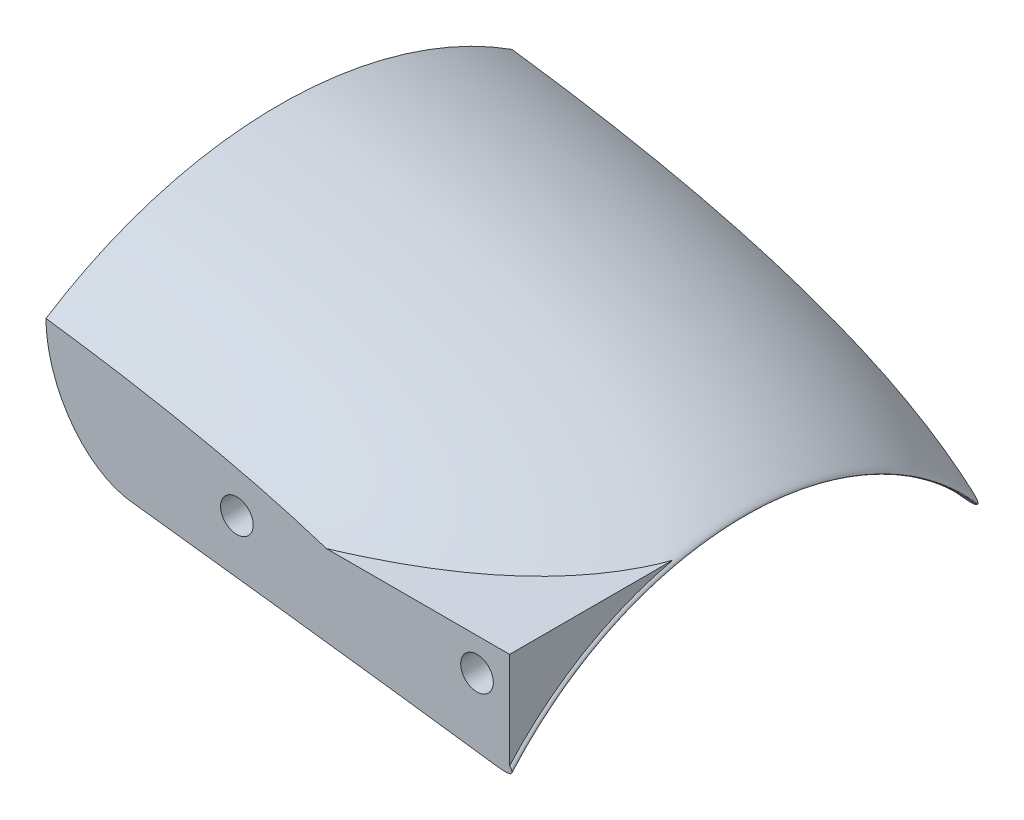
ISO-10303-21;
HEADER;
FILE_DESCRIPTION(('STEP AP214'),'2;1');
FILE_NAME('part.step','',(''),(''),'','','');
FILE_SCHEMA(('AUTOMOTIVE_DESIGN { 1 0 10303 214 1 1 1 1 }'));
ENDSEC;
DATA;
#1=APPLICATION_CONTEXT('core data for automotive mechanical design processes');
#2=APPLICATION_PROTOCOL_DEFINITION('international standard','automotive_design',2000,#1);
#3=PRODUCT_CONTEXT('',#1,'mechanical');
#4=PRODUCT('Part','Part','',(#3));
#5=PRODUCT_RELATED_PRODUCT_CATEGORY('part','',(#4));
#6=PRODUCT_DEFINITION_FORMATION('','',#4);
#7=PRODUCT_DEFINITION_CONTEXT('part definition',#1,'design');
#8=PRODUCT_DEFINITION('design','',#6,#7);
#9=PRODUCT_DEFINITION_SHAPE('','',#8);
#10=(LENGTH_UNIT() NAMED_UNIT(*) SI_UNIT(.MILLI.,.METRE.));
#11=(NAMED_UNIT(*) PLANE_ANGLE_UNIT() SI_UNIT($,.RADIAN.));
#12=(NAMED_UNIT(*) SI_UNIT($,.STERADIAN.) SOLID_ANGLE_UNIT());
#13=UNCERTAINTY_MEASURE_WITH_UNIT(LENGTH_MEASURE(1.E-05),#10,'distance_accuracy_value','');
#14=(GEOMETRIC_REPRESENTATION_CONTEXT(3) GLOBAL_UNCERTAINTY_ASSIGNED_CONTEXT((#13)) GLOBAL_UNIT_ASSIGNED_CONTEXT((#10,
#11,#12)) REPRESENTATION_CONTEXT('',''));
#15=CARTESIAN_POINT('',(0.,0.,0.));
#16=DIRECTION('',(0.,0.,1.));
#17=DIRECTION('',(1.,0.,0.));
#18=AXIS2_PLACEMENT_3D('',#15,#16,#17);
#19=CARTESIAN_POINT('',(0.,0.,0.));
#20=DIRECTION('',(-1.,0.,0.));
#21=DIRECTION('',(0.,0.,1.));
#22=AXIS2_PLACEMENT_3D('',#19,#20,#21);
#23=CONICAL_SURFACE('',#22,40.,0.0872664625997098);
#24=CARTESIAN_POINT('',(77.5638559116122,30.8708141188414,12.2541999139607));
#25=CARTESIAN_POINT('',(77.4918545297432,30.8624985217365,12.2922209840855));
#26=CARTESIAN_POINT('',(77.4248429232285,30.8502434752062,12.3387961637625));
#27=CARTESIAN_POINT('',(77.2997751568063,30.8207230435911,12.4416149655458));
#28=CARTESIAN_POINT('',(77.2417930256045,30.8034192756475,12.4979312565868));
#29=CARTESIAN_POINT('',(77.1376205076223,30.7670071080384,12.6113299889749));
#30=CARTESIAN_POINT('',(77.0908544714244,30.7481602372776,12.6679769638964));
#31=CARTESIAN_POINT('',(77.0023357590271,30.7083295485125,12.7843911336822));
#32=CARTESIAN_POINT('',(76.9605883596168,30.6873435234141,12.8441615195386));
#33=CARTESIAN_POINT('',(76.8812954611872,30.6437000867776,12.9657545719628));
#34=CARTESIAN_POINT('',(76.8437472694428,30.6210437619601,13.0275758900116));
#35=CARTESIAN_POINT('',(76.7721803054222,30.5743135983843,13.1527246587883));
#36=CARTESIAN_POINT('',(76.7381628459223,30.5502392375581,13.2160526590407));
#37=CARTESIAN_POINT('',(76.6681218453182,30.4969969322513,13.3537972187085));
#38=CARTESIAN_POINT('',(76.6326183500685,30.4676217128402,13.4283972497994));
#39=CARTESIAN_POINT('',(76.5652222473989,30.4074170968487,13.5786418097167));
#40=CARTESIAN_POINT('',(76.5333304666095,30.3765873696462,13.6542865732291));
#41=CARTESIAN_POINT('',(76.4424646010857,30.28206833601,13.8824634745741));
#42=CARTESIAN_POINT('',(76.3883554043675,30.21639267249,14.0361258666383));
#43=CARTESIAN_POINT('',(76.2912844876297,30.0802446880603,14.3453232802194));
#44=CARTESIAN_POINT('',(76.2483540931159,30.0097595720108,14.5008623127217));
#45=CARTESIAN_POINT('',(76.1731324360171,29.8645030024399,14.8125240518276));
#46=CARTESIAN_POINT('',(76.14084227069,29.7897311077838,14.9686468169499));
#47=CARTESIAN_POINT('',(76.0836918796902,29.6272226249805,15.2989211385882));
#48=CARTESIAN_POINT('',(76.0601338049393,29.5389899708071,15.4730561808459));
#49=CARTESIAN_POINT('',(76.0268626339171,29.3577801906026,15.8203142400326));
#50=CARTESIAN_POINT('',(76.0171574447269,29.2648003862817,15.9934366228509));
#51=CARTESIAN_POINT('',(76.0131031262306,29.0747453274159,16.3371078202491));
#52=CARTESIAN_POINT('',(76.0187132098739,28.9776816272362,16.5076622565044));
#53=CARTESIAN_POINT('',(76.040438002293,28.8294024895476,16.7606420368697));
#54=CARTESIAN_POINT('',(76.0498920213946,28.7795474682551,16.8444633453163));
#55=CARTESIAN_POINT('',(76.0736777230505,28.6790503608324,17.0109247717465));
#56=CARTESIAN_POINT('',(76.0880082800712,28.6284084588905,17.0935651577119));
#57=CARTESIAN_POINT('',(76.1217899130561,28.5273740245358,17.2559344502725));
#58=CARTESIAN_POINT('',(76.1411487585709,28.4769921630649,17.3356889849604));
#59=CARTESIAN_POINT('',(76.1857290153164,28.3758716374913,17.493285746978));
#60=CARTESIAN_POINT('',(76.2109480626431,28.3251331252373,17.5711287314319));
#61=CARTESIAN_POINT('',(76.2679659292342,28.2237737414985,17.7241006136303));
#62=CARTESIAN_POINT('',(76.2997443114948,28.1731529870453,17.799237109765));
#63=CARTESIAN_POINT('',(76.3708932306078,28.072419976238,17.9461350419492));
#64=CARTESIAN_POINT('',(76.4102573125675,28.0223073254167,18.0178992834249));
#65=CARTESIAN_POINT('',(76.496310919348,27.9250348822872,18.1544693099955));
#66=CARTESIAN_POINT('',(76.5427040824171,27.8778327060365,18.219429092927));
#67=CARTESIAN_POINT('',(76.6450224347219,27.7857226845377,18.3433521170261));
#68=CARTESIAN_POINT('',(76.7009461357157,27.7408144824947,18.4023162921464));
#69=CARTESIAN_POINT('',(76.8140873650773,27.6617434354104,18.5031268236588));
#70=CARTESIAN_POINT('',(76.86977224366,27.626992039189,18.5462105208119));
#71=CARTESIAN_POINT('',(76.9892518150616,27.562117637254,18.6238216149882));
#72=CARTESIAN_POINT('',(77.0530310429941,27.5319860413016,18.6583649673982));
#73=CARTESIAN_POINT('',(77.1719742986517,27.4849003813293,18.7091526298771));
#74=CARTESIAN_POINT('',(77.2255386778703,27.4665189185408,18.727798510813));
#75=CARTESIAN_POINT('',(77.3361871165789,27.4346905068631,18.7572473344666));
#76=CARTESIAN_POINT('',(77.3932680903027,27.4212393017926,18.7680570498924));
#77=CARTESIAN_POINT('',(77.5097379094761,27.4000430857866,18.7809715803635));
#78=CARTESIAN_POINT('',(77.5691360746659,27.3923243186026,18.7830365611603));
#79=CARTESIAN_POINT('',(77.6880454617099,27.3830449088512,18.7781734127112));
#80=CARTESIAN_POINT('',(77.7475567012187,27.3814853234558,18.7712437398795));
#81=CARTESIAN_POINT('',(77.8611131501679,27.3841715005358,18.7497444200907));
#82=CARTESIAN_POINT('',(77.9152666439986,27.3880580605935,18.7356830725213));
#83=CARTESIAN_POINT('',(78.0209321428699,27.4004181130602,18.7012081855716));
#84=CARTESIAN_POINT('',(78.0724431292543,27.4088933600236,18.6807922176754));
#85=CARTESIAN_POINT('',(78.1971987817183,27.4349356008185,18.6231184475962));
#86=CARTESIAN_POINT('',(78.2684030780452,27.4549302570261,18.582547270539));
#87=CARTESIAN_POINT('',(78.4028428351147,27.5013083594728,18.4927715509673));
#88=CARTESIAN_POINT('',(78.466056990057,27.527708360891,18.4435447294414));
#89=CARTESIAN_POINT('',(78.6192760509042,27.6016521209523,18.3086002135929));
#90=CARTESIAN_POINT('',(78.7035533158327,27.6525780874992,18.2182781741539));
#91=CARTESIAN_POINT('',(78.8557306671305,27.760900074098,18.028361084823));
#92=CARTESIAN_POINT('',(78.9235951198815,27.8183097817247,17.9287464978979));
#93=CARTESIAN_POINT('',(79.0385939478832,27.9301188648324,17.7352186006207));
#94=CARTESIAN_POINT('',(79.087205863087,27.9841223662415,17.6419380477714));
#95=CARTESIAN_POINT('',(79.1750581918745,28.0939093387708,17.4520173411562));
#96=CARTESIAN_POINT('',(79.2142914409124,28.1496941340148,17.3553746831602));
#97=CARTESIAN_POINT('',(79.284566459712,28.2623173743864,17.159521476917));
#98=CARTESIAN_POINT('',(79.3155926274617,28.3191576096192,17.0603064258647));
#99=CARTESIAN_POINT('',(79.3702603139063,28.4332576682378,16.8600835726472));
#100=CARTESIAN_POINT('',(79.3938993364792,28.4905176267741,16.7590751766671));
#101=CARTESIAN_POINT('',(79.4488275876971,28.6454712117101,16.4839741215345));
#102=CARTESIAN_POINT('',(79.4737446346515,28.7431852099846,16.3086050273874));
#103=CARTESIAN_POINT('',(79.5066180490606,28.9373841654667,15.9555378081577));
#104=CARTESIAN_POINT('',(79.5145610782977,29.0338680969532,15.7778379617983));
#105=CARTESIAN_POINT('',(79.5148951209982,29.2247783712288,15.4212868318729));
#106=CARTESIAN_POINT('',(79.5072821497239,29.3192041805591,15.242435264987));
#107=CARTESIAN_POINT('',(79.4771182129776,29.5053774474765,14.8847102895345));
#108=CARTESIAN_POINT('',(79.4545758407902,29.5971264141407,14.7058369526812));
#109=CARTESIAN_POINT('',(79.406893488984,29.7397040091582,14.4239688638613));
#110=CARTESIAN_POINT('',(79.3868084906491,29.7915556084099,14.3206152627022));
#111=CARTESIAN_POINT('',(79.3412372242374,29.8941426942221,14.1145531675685));
#112=CARTESIAN_POINT('',(79.3157517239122,29.9448783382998,14.011844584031));
#113=CARTESIAN_POINT('',(79.2590022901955,30.0450487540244,13.8076366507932));
#114=CARTESIAN_POINT('',(79.2277493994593,30.0944858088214,13.7061353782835));
#115=CARTESIAN_POINT('',(79.1587381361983,30.1920089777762,13.5047460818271));
#116=CARTESIAN_POINT('',(79.1209821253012,30.2400955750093,13.4048574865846));
#117=CARTESIAN_POINT('',(79.035354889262,30.3375742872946,13.2015991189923));
#118=CARTESIAN_POINT('',(78.9870150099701,30.3868734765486,13.0983765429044));
#119=CARTESIAN_POINT('',(78.9064013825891,30.4591749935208,12.9470342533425));
#120=CARTESIAN_POINT('',(78.87817011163,30.4830076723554,12.8971546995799));
#121=CARTESIAN_POINT('',(78.8185714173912,30.5300080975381,12.7989901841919));
#122=CARTESIAN_POINT('',(78.7872049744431,30.5531760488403,12.7507047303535));
#123=CARTESIAN_POINT('',(78.7101635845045,30.6059796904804,12.641178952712));
#124=CARTESIAN_POINT('',(78.6631220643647,30.635312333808,12.5807381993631));
#125=CARTESIAN_POINT('',(78.5609493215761,30.6918505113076,12.4659424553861));
#126=CARTESIAN_POINT('',(78.5058357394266,30.7190604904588,12.4115746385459));
#127=CARTESIAN_POINT('',(78.4097037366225,30.7596551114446,12.3331647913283));
#128=CARTESIAN_POINT('',(78.3719666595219,30.7741893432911,12.3057360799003));
#129=CARTESIAN_POINT('',(78.2925023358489,30.8014274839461,12.2562152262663));
#130=CARTESIAN_POINT('',(78.2507810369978,30.8141340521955,12.2341152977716));
#131=CARTESIAN_POINT('',(78.1721651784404,30.834674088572,12.2009536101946));
#132=CARTESIAN_POINT('',(78.1359593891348,30.8429741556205,12.1885709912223));
#133=CARTESIAN_POINT('',(78.0616349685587,30.8574246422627,12.1696758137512));
#134=CARTESIAN_POINT('',(78.023518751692,30.8635777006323,12.1631560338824));
#135=CARTESIAN_POINT('',(77.9461997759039,30.8733846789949,12.1567172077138));
#136=CARTESIAN_POINT('',(77.9069924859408,30.8770257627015,12.1568318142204));
#137=CARTESIAN_POINT('',(77.8290067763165,30.8816371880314,12.1637423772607));
#138=CARTESIAN_POINT('',(77.7902286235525,30.8826059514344,12.1705422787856));
#139=CARTESIAN_POINT('',(77.7194152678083,30.8821037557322,12.1887007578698));
#140=CARTESIAN_POINT('',(77.6871791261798,30.8809460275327,12.1993155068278));
#141=CARTESIAN_POINT('',(77.6242962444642,30.8770213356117,12.2241995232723));
#142=CARTESIAN_POINT('',(77.5936489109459,30.8742549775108,12.2384674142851));
#143=CARTESIAN_POINT('',(77.5638559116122,30.8708141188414,12.2541999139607));
#144=B_SPLINE_CURVE_WITH_KNOTS('',3,(#24,#25,#26,#27,#28,#29,#30,#31,#32,#33,#34,#35,#36,#37,
#38,#39,#40,#41,#42,#43,#44,#45,#46,#47,#48,#49,#50,#51,#52,#53,#54,#55,#56,#57,#58,#59,#60,#61,
#62,#63,#64,#65,#66,#67,#68,#69,#70,#71,#72,#73,#74,#75,#76,#77,#78,#79,#80,#81,#82,#83,#84,#85,
#86,#87,#88,#89,#90,#91,#92,#93,#94,#95,#96,#97,#98,#99,#100,#101,#102,#103,#104,#105,#106,#107,
#108,#109,#110,#111,#112,#113,#114,#115,#116,#117,#118,#119,#120,#121,#122,#123,#124,#125,#126,
#127,#128,#129,#130,#131,#132,#133,#134,#135,#136,#137,#138,#139,#140,#141,#142,#143),
.UNSPECIFIED.,.T.,.F.,(4,2,2,2,2,2,2,2,2,2,2,2,2,2,2,2,2,2,2,2,2,2,2,2,2,2,2,2,2,2,2,2,2,2,2,2,
2,2,2,2,2,2,2,2,2,2,2,2,2,2,2,2,2,2,2,2,2,2,2,4),(0.,0.245378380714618,0.492673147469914,
0.71983930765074,0.947242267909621,1.17449856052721,1.40183904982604,1.66478024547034,
1.92778150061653,2.45418056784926,2.98203922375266,3.50995229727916,4.09930766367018,
4.68899929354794,5.27712201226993,5.57096967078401,5.86474955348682,6.15348071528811,
6.44209560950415,6.72982448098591,7.01730958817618,7.29496873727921,7.57258456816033,
7.80734103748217,8.04165555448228,8.21980267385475,8.39779563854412,8.57659853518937,
8.75543212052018,8.92301017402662,9.0906523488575,9.3422812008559,9.59456747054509,
9.99318538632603,10.392661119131,10.7468769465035,11.101362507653,11.4565171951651,
11.8117917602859,12.417761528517,13.0242072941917,13.630808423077,14.2370606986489,
14.5890388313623,14.9409669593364,15.292228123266,15.6433619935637,16.0154173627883,
16.2015537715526,16.3876321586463,16.6332628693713,16.8783645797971,17.024603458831,
17.1706273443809,17.2876286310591,17.4044856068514,17.5219353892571,17.6394545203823,
17.7410263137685,17.8425598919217),.UNSPECIFIED.);
#145=CARTESIAN_POINT('',(77.5638559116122,30.8708141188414,12.2541999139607));
#146=VERTEX_POINT('',#145);
#147=EDGE_CURVE('E178',#146,#146,#144,.T.);
#148=ORIENTED_EDGE('',*,*,#147,.T.);
#149=EDGE_LOOP('',(#148));
#150=FACE_BOUND('',#149,.T.);
#151=CARTESIAN_POINT('',(-22.9959396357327,33.7638623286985,25.));
#152=CARTESIAN_POINT('',(-20.2365086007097,33.4634646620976,25.));
#153=CARTESIAN_POINT('',(-17.4772295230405,33.1616717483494,25.));
#154=CARTESIAN_POINT('',(-11.9590052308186,32.5550403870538,25.));
#155=CARTESIAN_POINT('',(-9.20006001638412,32.2502019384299,25.));
#156=CARTESIAN_POINT('',(-0.92374426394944,31.3307328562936,25.));
#157=CARTESIAN_POINT('',(4.59307762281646,30.7111516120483,25.));
#158=CARTESIAN_POINT('',(15.6276129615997,29.4559212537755,25.));
#159=CARTESIAN_POINT('',(21.1453255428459,28.8202644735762,25.));
#160=CARTESIAN_POINT('',(32.178501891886,27.5297799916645,25.));
#161=CARTESIAN_POINT('',(37.6939656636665,26.8749523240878,25.));
#162=CARTESIAN_POINT('',(48.7219723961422,25.5415859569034,25.));
#163=CARTESIAN_POINT('',(54.2345153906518,24.8630475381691,25.));
#164=CARTESIAN_POINT('',(62.500490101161,23.8225736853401,25.));
#165=CARTESIAN_POINT('',(65.2553491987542,23.47197037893,25.));
#166=CARTESIAN_POINT('',(70.7639528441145,22.7621078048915,25.));
#167=CARTESIAN_POINT('',(73.5176973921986,22.402848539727,25.));
#168=CARTESIAN_POINT('',(79.0230878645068,21.6744749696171,25.));
#169=CARTESIAN_POINT('',(81.7747341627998,21.3053634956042,25.));
#170=CARTESIAN_POINT('',(87.276446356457,20.5555494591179,25.));
#171=CARTESIAN_POINT('',(90.0265122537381,20.1748469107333,25.));
#172=CARTESIAN_POINT('',(95.5247230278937,19.3997661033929,25.));
#173=CARTESIAN_POINT('',(98.2728679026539,19.00538782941,25.));
#174=CARTESIAN_POINT('',(103.766752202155,18.2002434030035,25.));
#175=CARTESIAN_POINT('',(106.512491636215,17.7894773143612,25.));
#176=CARTESIAN_POINT('',(112.00146855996,16.9478152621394,25.));
#177=CARTESIAN_POINT('',(114.744705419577,16.5169151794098,25.));
#178=CARTESIAN_POINT('',(120.227057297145,15.630041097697,25.));
#179=CARTESIAN_POINT('',(122.966172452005,15.1740679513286,25.));
#180=CARTESIAN_POINT('',(127.0710254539,14.4655804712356,25.));
#181=CARTESIAN_POINT('',(128.438874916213,14.225292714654,25.));
#182=CARTESIAN_POINT('',(131.172864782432,13.7352281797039,25.));
#183=CARTESIAN_POINT('',(132.539005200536,13.4854514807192,25.));
#184=CARTESIAN_POINT('',(135.269355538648,12.9747596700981,25.));
#185=CARTESIAN_POINT('',(136.633565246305,12.7138434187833,25.));
#186=CARTESIAN_POINT('',(138.677944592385,12.312515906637,25.));
#187=CARTESIAN_POINT('',(139.35909179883,12.1770791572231,25.));
#188=CARTESIAN_POINT('',(140.72065048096,11.9025378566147,25.));
#189=CARTESIAN_POINT('',(141.401061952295,11.763433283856,25.));
#190=CARTESIAN_POINT('',(142.081059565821,11.6223199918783,25.));
#191=B_SPLINE_CURVE_WITH_KNOTS('',3,(#151,#152,#153,#154,#155,#156,#157,#158,#159,#160,#161,
#162,#163,#164,#165,#166,#167,#168,#169,#170,#171,#172,#173,#174,#175,#176,#177,#178,#179,#180,
#181,#182,#183,#184,#185,#186,#187,#188,#189,#190),.UNSPECIFIED.,.F.,.F.,(4,2,2,2,2,2,2,2,2,2,2,
2,2,2,2,2,2,2,2,4),(0.,8.32720089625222,16.6544047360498,33.3088992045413,49.9714915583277,
66.6340542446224,83.2964196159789,91.6276476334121,99.95887327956,108.287730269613,
116.616577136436,124.945433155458,133.274256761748,141.604791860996,149.935043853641,
154.101400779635,158.267722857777,162.434472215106,164.517907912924,166.601355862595),.UNSPECIFIED.);
#192=CARTESIAN_POINT('',(79.9999999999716,21.5420485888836,25.));
#193=VERTEX_POINT('',#192);
#194=CARTESIAN_POINT('',(40.6470926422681,26.5170414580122,25.));
#195=VERTEX_POINT('',#194);
#196=EDGE_CURVE('E102',#193,#195,#191,.F.);
#197=ORIENTED_EDGE('',*,*,#196,.T.);
#198=CARTESIAN_POINT('',(40.6470926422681,0.,0.));
#199=DIRECTION('',(-1.,0.,0.));
#200=DIRECTION('',(0.,0.,1.));
#201=AXIS2_PLACEMENT_3D('',#198,#199,#200);
#202=CIRCLE('',#201,36.4438401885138);
#203=CARTESIAN_POINT('',(40.6470926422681,26.5170414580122,-25.));
#204=VERTEX_POINT('',#203);
#205=EDGE_CURVE('E104',#195,#204,#202,.T.);
#206=ORIENTED_EDGE('',*,*,#205,.T.);
#207=CARTESIAN_POINT('',(-22.9959396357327,33.7638623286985,-25.));
#208=CARTESIAN_POINT('',(-20.2365086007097,33.4634646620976,-25.));
#209=CARTESIAN_POINT('',(-17.4772295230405,33.1616717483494,-25.));
#210=CARTESIAN_POINT('',(-11.9590052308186,32.5550403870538,-25.));
#211=CARTESIAN_POINT('',(-9.20006001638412,32.2502019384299,-25.));
#212=CARTESIAN_POINT('',(-0.92374426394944,31.3307328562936,-25.));
#213=CARTESIAN_POINT('',(4.59307762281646,30.7111516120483,-25.));
#214=CARTESIAN_POINT('',(15.6276129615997,29.4559212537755,-25.));
#215=CARTESIAN_POINT('',(21.1453255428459,28.8202644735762,-25.));
#216=CARTESIAN_POINT('',(32.178501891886,27.5297799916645,-25.));
#217=CARTESIAN_POINT('',(37.6939656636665,26.8749523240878,-25.));
#218=CARTESIAN_POINT('',(48.7219723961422,25.5415859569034,-25.));
#219=CARTESIAN_POINT('',(54.2345153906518,24.8630475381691,-25.));
#220=CARTESIAN_POINT('',(62.500490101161,23.8225736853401,-25.));
#221=CARTESIAN_POINT('',(65.2553491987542,23.47197037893,-25.));
#222=CARTESIAN_POINT('',(70.7639528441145,22.7621078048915,-25.));
#223=CARTESIAN_POINT('',(73.5176973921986,22.402848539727,-25.));
#224=CARTESIAN_POINT('',(79.0230878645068,21.6744749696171,-25.));
#225=CARTESIAN_POINT('',(81.7747341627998,21.3053634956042,-25.));
#226=CARTESIAN_POINT('',(87.276446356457,20.5555494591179,-25.));
#227=CARTESIAN_POINT('',(90.0265122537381,20.1748469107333,-25.));
#228=CARTESIAN_POINT('',(95.5247230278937,19.3997661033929,-25.));
#229=CARTESIAN_POINT('',(98.2728679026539,19.00538782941,-25.));
#230=CARTESIAN_POINT('',(103.766752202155,18.2002434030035,-25.));
#231=CARTESIAN_POINT('',(106.512491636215,17.7894773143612,-25.));
#232=CARTESIAN_POINT('',(112.00146855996,16.9478152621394,-25.));
#233=CARTESIAN_POINT('',(114.744705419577,16.5169151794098,-25.));
#234=CARTESIAN_POINT('',(120.227057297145,15.630041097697,-25.));
#235=CARTESIAN_POINT('',(122.966172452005,15.1740679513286,-25.));
#236=CARTESIAN_POINT('',(127.0710254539,14.4655804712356,-25.));
#237=CARTESIAN_POINT('',(128.438874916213,14.225292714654,-25.));
#238=CARTESIAN_POINT('',(131.172864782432,13.7352281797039,-25.));
#239=CARTESIAN_POINT('',(132.539005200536,13.4854514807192,-25.));
#240=CARTESIAN_POINT('',(135.269355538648,12.9747596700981,-25.));
#241=CARTESIAN_POINT('',(136.633565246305,12.7138434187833,-25.));
#242=CARTESIAN_POINT('',(138.677944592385,12.312515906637,-25.));
#243=CARTESIAN_POINT('',(139.35909179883,12.1770791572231,-25.));
#244=CARTESIAN_POINT('',(140.72065048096,11.9025378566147,-25.));
#245=CARTESIAN_POINT('',(141.401061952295,11.763433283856,-25.));
#246=CARTESIAN_POINT('',(142.081059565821,11.6223199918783,-25.));
#247=B_SPLINE_CURVE_WITH_KNOTS('',3,(#207,#208,#209,#210,#211,#212,#213,#214,#215,#216,#217,
#218,#219,#220,#221,#222,#223,#224,#225,#226,#227,#228,#229,#230,#231,#232,#233,#234,#235,#236,
#237,#238,#239,#240,#241,#242,#243,#244,#245,#246),.UNSPECIFIED.,.F.,.F.,(4,2,2,2,2,2,2,2,2,2,2,
2,2,2,2,2,2,2,2,4),(0.,8.32720089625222,16.6544047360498,33.3088992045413,49.9714915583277,
66.6340542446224,83.2964196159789,91.6276476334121,99.95887327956,108.287730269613,
116.616577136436,124.945433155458,133.274256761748,141.604791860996,149.935043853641,
154.101400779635,158.267722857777,162.434472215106,164.517907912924,166.601355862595),.UNSPECIFIED.);
#248=CARTESIAN_POINT('',(80.,21.5420485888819,-24.9999999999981));
#249=VERTEX_POINT('',#248);
#250=EDGE_CURVE('E115',#204,#249,#247,.T.);
#251=ORIENTED_EDGE('',*,*,#250,.T.);
#252=CARTESIAN_POINT('',(80.,0.,0.));
#253=DIRECTION('',(1.,0.,0.));
#254=DIRECTION('',(0.,0.,-1.));
#255=AXIS2_PLACEMENT_3D('',#252,#253,#254);
#256=CIRCLE('',#255,33.0009069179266);
#257=EDGE_CURVE('E150',#249,#193,#256,.T.);
#258=ORIENTED_EDGE('',*,*,#257,.T.);
#259=EDGE_LOOP('',(#197,#206,#251,#258));
#260=FACE_BOUND('',#259,.T.);
#261=ADVANCED_FACE('F34',(#150,#260),#23,.F.);
#262=CARTESIAN_POINT('',(-16.2695424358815,49.2273731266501,0.));
#263=CARTESIAN_POINT('',(57.7000408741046,47.5160802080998,0.));
#264=CARTESIAN_POINT('',(82.4369177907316,32.8053972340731,0.));
#265=CARTESIAN_POINT('',(80.,33.0009069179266,0.));
#266=B_SPLINE_CURVE_WITH_KNOTS('',2,(#262,#263,#264,#265),.UNSPECIFIED.,.F.,.F.,(3,1,3),(0.,
0.940488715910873,1.),.UNSPECIFIED.);
#267=CARTESIAN_POINT('',(122.454525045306,0.,0.));
#268=DIRECTION('',(1.,0.,0.));
#269=AXIS1_PLACEMENT('',#267,#268);
#270=SURFACE_OF_REVOLUTION('',#266,#269);
#271=CARTESIAN_POINT('',(80.,21.5420485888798,25.));
#272=CARTESIAN_POINT('',(80.0426055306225,21.5368157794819,25.));
#273=CARTESIAN_POINT('',(80.0852436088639,21.5318369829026,25.));
#274=CARTESIAN_POINT('',(80.1706365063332,21.5224756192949,25.));
#275=CARTESIAN_POINT('',(80.213391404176,21.5180937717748,25.));
#276=CARTESIAN_POINT('',(80.2989880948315,21.5100255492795,25.));
#277=CARTESIAN_POINT('',(80.3418299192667,21.5063395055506,25.));
#278=CARTESIAN_POINT('',(80.428442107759,21.4997284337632,25.));
#279=CARTESIAN_POINT('',(80.4722137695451,21.4968202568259,25.));
#280=CARTESIAN_POINT('',(80.5598005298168,21.4920429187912,25.));
#281=CARTESIAN_POINT('',(80.6036156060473,21.4901733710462,25.));
#282=CARTESIAN_POINT('',(80.6912645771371,21.4877279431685,25.));
#283=CARTESIAN_POINT('',(80.7350984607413,21.4871516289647,25.));
#284=CARTESIAN_POINT('',(80.8443835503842,21.4877337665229,25.));
#285=CARTESIAN_POINT('',(80.9098445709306,21.4898868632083,25.));
#286=CARTESIAN_POINT('',(81.0075610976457,21.4973606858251,25.));
#287=CARTESIAN_POINT('',(81.0399773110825,21.5005467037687,25.));
#288=CARTESIAN_POINT('',(81.1045662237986,21.508785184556,25.));
#289=CARTESIAN_POINT('',(81.136739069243,21.5138364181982,25.));
#290=CARTESIAN_POINT('',(81.1911062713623,21.5246201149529,25.));
#291=CARTESIAN_POINT('',(81.2134271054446,21.5297050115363,25.));
#292=CARTESIAN_POINT('',(81.2576868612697,21.5415304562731,25.));
#293=CARTESIAN_POINT('',(81.2796249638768,21.5482741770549,25.));
#294=CARTESIAN_POINT('',(81.3229259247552,21.5640168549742,25.));
#295=CARTESIAN_POINT('',(81.3442816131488,21.5730360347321,25.));
#296=CARTESIAN_POINT('',(81.3854682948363,21.5940882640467,25.));
#297=CARTESIAN_POINT('',(81.405304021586,21.6061114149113,25.));
#298=CARTESIAN_POINT('',(81.4342001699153,21.6281441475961,25.));
#299=CARTESIAN_POINT('',(81.4442552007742,21.6368350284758,25.));
#300=CARTESIAN_POINT('',(81.4629326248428,21.6556260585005,25.));
#301=CARTESIAN_POINT('',(81.4715583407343,21.6657228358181,25.));
#302=CARTESIAN_POINT('',(81.4869855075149,21.6874087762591,25.));
#303=CARTESIAN_POINT('',(81.4937665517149,21.6990126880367,25.));
#304=CARTESIAN_POINT('',(81.504967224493,21.723310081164,25.));
#305=CARTESIAN_POINT('',(81.5093876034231,21.736003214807,25.));
#306=CARTESIAN_POINT('',(81.5154405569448,21.7605674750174,25.));
#307=CARTESIAN_POINT('',(81.5173229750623,21.7723789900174,25.));
#308=CARTESIAN_POINT('',(81.5193188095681,21.7961606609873,25.));
#309=CARTESIAN_POINT('',(81.5194287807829,21.808131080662,25.));
#310=CARTESIAN_POINT('',(81.5177314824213,21.8395834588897,25.));
#311=CARTESIAN_POINT('',(81.5146582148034,21.85899269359,25.));
#312=CARTESIAN_POINT('',(81.5056519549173,21.897130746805,25.));
#313=CARTESIAN_POINT('',(81.4997099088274,21.9158572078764,25.));
#314=CARTESIAN_POINT('',(81.4840711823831,21.9571949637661,25.));
#315=CARTESIAN_POINT('',(81.4738042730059,21.9795855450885,25.));
#316=CARTESIAN_POINT('',(81.451212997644,22.0232470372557,25.));
#317=CARTESIAN_POINT('',(81.4388899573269,22.0445186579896,25.));
#318=CARTESIAN_POINT('',(81.4127092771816,22.086279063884,25.));
#319=CARTESIAN_POINT('',(81.3988421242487,22.1067618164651,25.));
#320=CARTESIAN_POINT('',(81.3700373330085,22.1469399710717,25.));
#321=CARTESIAN_POINT('',(81.3551000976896,22.1666356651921,25.));
#322=CARTESIAN_POINT('',(81.31919597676,22.2119508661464,25.));
#323=CARTESIAN_POINT('',(81.2979036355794,22.2373114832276,25.));
#324=CARTESIAN_POINT('',(81.254243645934,22.2870910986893,25.));
#325=CARTESIAN_POINT('',(81.2318757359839,22.3115098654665,25.));
#326=CARTESIAN_POINT('',(81.1862694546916,22.3596187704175,25.));
#327=CARTESIAN_POINT('',(81.1630292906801,22.3833072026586,25.));
#328=CARTESIAN_POINT('',(81.1158978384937,22.4300153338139,25.));
#329=CARTESIAN_POINT('',(81.0920066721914,22.4530351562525,25.));
#330=CARTESIAN_POINT('',(81.0436594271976,22.4985648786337,25.));
#331=CARTESIAN_POINT('',(81.0192023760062,22.5210737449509,25.));
#332=CARTESIAN_POINT('',(80.9821528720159,22.5544331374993,25.));
#333=CARTESIAN_POINT('',(80.9697418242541,22.5654860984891,25.));
#334=CARTESIAN_POINT('',(80.9448844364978,22.5875524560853,25.));
#335=CARTESIAN_POINT('',(80.9324380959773,22.5985658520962,25.));
#336=CARTESIAN_POINT('',(80.8950544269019,22.6316014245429,25.));
#337=CARTESIAN_POINT('',(80.8700951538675,22.6535988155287,25.));
#338=CARTESIAN_POINT('',(80.8201030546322,22.6975093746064,25.));
#339=CARTESIAN_POINT('',(80.7950702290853,22.7194225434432,25.));
#340=CARTESIAN_POINT('',(80.7199538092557,22.7849679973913,25.));
#341=CARTESIAN_POINT('',(80.6697667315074,22.8284818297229,25.));
#342=CARTESIAN_POINT('',(80.5691531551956,22.915161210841,25.));
#343=CARTESIAN_POINT('',(80.5187268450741,22.9583269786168,25.));
#344=CARTESIAN_POINT('',(80.3176677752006,23.1293530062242,25.));
#345=CARTESIAN_POINT('',(80.1659784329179,23.2559752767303,25.));
#346=CARTESIAN_POINT('',(79.8602415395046,23.5065544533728,25.));
#347=CARTESIAN_POINT('',(79.7061924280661,23.6305094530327,25.));
#348=CARTESIAN_POINT('',(79.3958976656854,23.8757616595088,25.));
#349=CARTESIAN_POINT('',(79.239651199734,23.9970578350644,25.));
#350=CARTESIAN_POINT('',(78.9251278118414,24.2370008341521,25.));
#351=CARTESIAN_POINT('',(78.7668508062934,24.3556475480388,25.));
#352=CARTESIAN_POINT('',(78.4490676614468,24.5898365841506,25.));
#353=CARTESIAN_POINT('',(78.2895697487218,24.7053900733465,25.));
#354=CARTESIAN_POINT('',(77.9688083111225,24.9339553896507,25.));
#355=CARTESIAN_POINT('',(77.8075451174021,25.0469676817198,25.));
#356=CARTESIAN_POINT('',(77.4833361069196,25.2705205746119,25.));
#357=CARTESIAN_POINT('',(77.3203904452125,25.3810614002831,25.));
#358=CARTESIAN_POINT('',(76.9929005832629,25.5997360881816,25.));
#359=CARTESIAN_POINT('',(76.8283564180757,25.7078700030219,25.));
#360=CARTESIAN_POINT('',(76.1592443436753,26.1408340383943,25.));
#361=CARTESIAN_POINT('',(75.6483639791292,26.4559738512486,25.));
#362=CARTESIAN_POINT('',(74.614494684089,27.0662964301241,25.));
#363=CARTESIAN_POINT('',(74.0914989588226,27.3614676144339,25.));
#364=CARTESIAN_POINT('',(73.03512038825,27.9334823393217,25.));
#365=CARTESIAN_POINT('',(72.5017304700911,28.2103127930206,25.));
#366=CARTESIAN_POINT('',(71.4262219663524,28.7470413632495,25.));
#367=CARTESIAN_POINT('',(70.8840995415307,29.0069317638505,25.));
#368=CARTESIAN_POINT('',(69.792685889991,29.5110109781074,25.));
#369=CARTESIAN_POINT('',(69.2433953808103,29.7552013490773,25.));
#370=CARTESIAN_POINT('',(68.131605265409,30.2321979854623,25.));
#371=CARTESIAN_POINT('',(67.569026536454,30.4648194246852,25.));
#372=CARTESIAN_POINT('',(66.4387483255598,30.9163614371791,25.));
#373=CARTESIAN_POINT('',(65.8710516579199,31.1352890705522,25.));
#374=CARTESIAN_POINT('',(64.7311441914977,31.560594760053,25.));
#375=CARTESIAN_POINT('',(64.1589345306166,31.7669758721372,25.));
#376=CARTESIAN_POINT('',(63.0105534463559,32.1681895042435,25.));
#377=CARTESIAN_POINT('',(62.4343824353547,32.3630232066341,25.));
#378=CARTESIAN_POINT('',(61.2785888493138,32.7420161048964,25.));
#379=CARTESIAN_POINT('',(60.6989664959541,32.9261759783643,25.));
#380=CARTESIAN_POINT('',(59.327619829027,33.3490895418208,25.));
#381=CARTESIAN_POINT('',(58.5346016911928,33.5836512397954,25.));
#382=CARTESIAN_POINT('',(56.9438316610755,34.0362520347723,25.));
#383=CARTESIAN_POINT('',(56.146079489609,34.2542901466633,25.));
#384=CARTESIAN_POINT('',(54.5464411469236,34.6753767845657,25.));
#385=CARTESIAN_POINT('',(53.7445540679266,34.8784218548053,25.));
#386=CARTESIAN_POINT('',(52.1372013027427,35.270833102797,25.));
#387=CARTESIAN_POINT('',(51.3317346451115,35.4601952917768,25.));
#388=CARTESIAN_POINT('',(49.7177325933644,35.8263723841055,25.));
#389=CARTESIAN_POINT('',(48.9091964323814,36.0031839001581,25.));
#390=CARTESIAN_POINT('',(47.2895303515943,36.345245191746,25.));
#391=CARTESIAN_POINT('',(46.4783999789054,36.5104928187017,25.));
#392=CARTESIAN_POINT('',(44.8839796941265,36.824386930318,25.));
#393=CARTESIAN_POINT('',(44.1007658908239,36.973420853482,25.));
#394=CARTESIAN_POINT('',(42.5327243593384,37.2622503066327,25.));
#395=CARTESIAN_POINT('',(41.7478968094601,37.4020468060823,25.));
#396=CARTESIAN_POINT('',(40.1770164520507,37.6730080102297,25.));
#397=CARTESIAN_POINT('',(39.3909641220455,37.8041754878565,25.));
#398=CARTESIAN_POINT('',(37.818012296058,38.0584225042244,25.));
#399=CARTESIAN_POINT('',(37.031113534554,38.1815065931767,25.));
#400=CARTESIAN_POINT('',(35.4568399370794,38.4200809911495,25.));
#401=CARTESIAN_POINT('',(34.6694660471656,38.5355775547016,25.));
#402=CARTESIAN_POINT('',(33.0946011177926,38.7594141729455,25.));
#403=CARTESIAN_POINT('',(32.3071111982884,38.867762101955,25.));
#404=CARTESIAN_POINT('',(31.5191879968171,38.972826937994,25.));
#405=B_SPLINE_CURVE_WITH_KNOTS('',3,(#271,#272,#273,#274,#275,#276,#277,#278,#279,#280,#281,
#282,#283,#284,#285,#286,#287,#288,#289,#290,#291,#292,#293,#294,#295,#296,#297,#298,#299,#300,
#301,#302,#303,#304,#305,#306,#307,#308,#309,#310,#311,#312,#313,#314,#315,#316,#317,#318,#319,
#320,#321,#322,#323,#324,#325,#326,#327,#328,#329,#330,#331,#332,#333,#334,#335,#336,#337,#338,
#339,#340,#341,#342,#343,#344,#345,#346,#347,#348,#349,#350,#351,#352,#353,#354,#355,#356,#357,
#358,#359,#360,#361,#362,#363,#364,#365,#366,#367,#368,#369,#370,#371,#372,#373,#374,#375,#376,
#377,#378,#379,#380,#381,#382,#383,#384,#385,#386,#387,#388,#389,#390,#391,#392,#393,#394,#395,
#396,#397,#398,#399,#400,#401,#402,#403,#404),.UNSPECIFIED.,.F.,.F.,(4,2,2,2,2,2,2,2,2,2,2,2,2,
2,2,2,2,2,2,2,2,2,2,2,2,2,2,2,2,2,2,2,2,2,2,2,2,2,2,2,2,2,2,2,2,2,2,2,2,2,2,2,2,2,2,2,2,2,2,2,2,
2,2,2,2,2,4),(0.,0.128778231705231,0.257710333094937,0.386703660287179,0.518299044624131,
0.649845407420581,0.781347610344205,0.977642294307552,1.07532452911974,1.17294250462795,
1.24157650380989,1.31034280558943,1.37974321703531,1.44891788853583,1.48866984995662,
1.52832806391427,1.56840863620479,1.60847646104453,1.6442099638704,1.68001291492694,
1.73862395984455,1.79742120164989,1.87114567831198,1.94482280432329,2.01898198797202,
2.09311338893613,2.19241134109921,2.29173355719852,2.39127247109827,2.49079287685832,
2.59049931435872,2.6403569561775,2.69021534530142,2.7900232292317,2.88983022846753,
3.08910175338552,3.28823620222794,3.88097686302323,4.47412799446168,5.06750525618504,
5.66090702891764,6.25175379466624,6.84249155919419,7.43317535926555,8.02384623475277,
9.82404817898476,11.6252854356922,13.4277944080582,15.231118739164,17.0342639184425,
18.8603974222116,20.6855815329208,22.5103192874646,24.3348698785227,26.1593045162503,
28.6400358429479,31.1209149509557,33.6023641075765,36.0845337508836,38.5673707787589,
41.0506679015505,43.4424106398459,45.8339019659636,48.2246209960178,50.6139825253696,
53.0013490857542,55.3860404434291),.UNSPECIFIED.);
#406=CARTESIAN_POINT('',(61.6118663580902,32.6323811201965,25.));
#407=VERTEX_POINT('',#406);
#408=CARTESIAN_POINT('',(31.5191879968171,38.972826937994,25.));
#409=VERTEX_POINT('',#408);
#410=EDGE_CURVE('E105',#407,#409,#405,.T.);
#411=ORIENTED_EDGE('',*,*,#410,.F.);
#412=CARTESIAN_POINT('',(81.2647307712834,32.6323811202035,7.503668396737));
#413=CARTESIAN_POINT('',(81.250071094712,32.6323811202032,7.55255703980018));
#414=CARTESIAN_POINT('',(81.2349196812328,32.6323811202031,7.60129715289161));
#415=CARTESIAN_POINT('',(81.2036829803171,32.632381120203,7.69847249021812));
#416=CARTESIAN_POINT('',(81.1875977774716,32.632381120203,7.74690774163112));
#417=CARTESIAN_POINT('',(81.1545505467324,32.632381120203,7.84344481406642));
#418=CARTESIAN_POINT('',(81.1375890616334,32.632381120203,7.89154682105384));
#419=CARTESIAN_POINT('',(81.1028172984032,32.632381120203,7.98744291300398));
#420=CARTESIAN_POINT('',(81.0850070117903,32.632381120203,8.03523699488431));
#421=CARTESIAN_POINT('',(81.042496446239,32.632381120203,8.146482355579));
#422=CARTESIAN_POINT('',(81.0174865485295,32.632381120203,8.20981585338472));
#423=CARTESIAN_POINT('',(80.9788937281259,32.632381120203,8.30437631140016));
#424=CARTESIAN_POINT('',(80.9658492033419,32.632381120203,8.33582452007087));
#425=CARTESIAN_POINT('',(80.9395981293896,32.632381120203,8.39865348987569));
#426=CARTESIAN_POINT('',(80.9263915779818,32.632381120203,8.43003425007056));
#427=CARTESIAN_POINT('',(80.8865474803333,32.632381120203,8.52410551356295));
#428=CARTESIAN_POINT('',(80.8596938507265,32.632381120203,8.58670474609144));
#429=CARTESIAN_POINT('',(80.805400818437,32.632381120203,8.71164773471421));
#430=CARTESIAN_POINT('',(80.7779614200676,32.632381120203,8.77399149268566));
#431=CARTESIAN_POINT('',(80.694768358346,32.632381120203,8.96064921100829));
#432=CARTESIAN_POINT('',(80.638145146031,32.632381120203,9.08457706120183));
#433=CARTESIAN_POINT('',(80.522498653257,32.632381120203,9.3315973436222));
#434=CARTESIAN_POINT('',(80.4634709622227,32.632381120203,9.45468770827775));
#435=CARTESIAN_POINT('',(80.3431649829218,32.632381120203,9.69972727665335));
#436=CARTESIAN_POINT('',(80.2818872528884,32.632381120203,9.82167675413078));
#437=CARTESIAN_POINT('',(80.1571030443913,32.632381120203,10.0644308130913));
#438=CARTESIAN_POINT('',(80.0935964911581,32.632381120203,10.1852353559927));
#439=CARTESIAN_POINT('',(79.8173020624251,32.632381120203,10.6993660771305));
#440=CARTESIAN_POINT('',(79.5938010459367,32.632381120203,11.0870118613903));
#441=CARTESIAN_POINT('',(79.1244932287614,32.632381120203,11.8489443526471));
#442=CARTESIAN_POINT('',(78.8786674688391,32.632381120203,12.223219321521));
#443=CARTESIAN_POINT('',(78.3664044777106,32.632381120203,12.9574755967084));
#444=CARTESIAN_POINT('',(78.0999636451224,32.632381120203,13.3174543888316));
#445=CARTESIAN_POINT('',(77.5480597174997,32.632381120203,14.0228136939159));
#446=CARTESIAN_POINT('',(77.2625860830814,32.632381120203,14.368185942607));
#447=CARTESIAN_POINT('',(76.6745476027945,32.632381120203,15.043889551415));
#448=CARTESIAN_POINT('',(76.3719869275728,32.632381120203,15.3742245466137));
#449=CARTESIAN_POINT('',(75.7514290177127,32.632381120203,16.0200083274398));
#450=CARTESIAN_POINT('',(75.4334318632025,32.632381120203,16.3354571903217));
#451=CARTESIAN_POINT('',(74.6110913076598,32.632381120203,17.1153690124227));
#452=CARTESIAN_POINT('',(74.0974354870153,32.632381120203,17.5700453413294));
#453=CARTESIAN_POINT('',(73.0428222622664,32.632381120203,18.4469715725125));
#454=CARTESIAN_POINT('',(72.5018488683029,32.632381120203,18.8692021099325));
#455=CARTESIAN_POINT('',(71.3973097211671,32.632381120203,19.6831974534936));
#456=CARTESIAN_POINT('',(70.8337380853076,32.632381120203,20.0749542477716));
#457=CARTESIAN_POINT('',(69.6864738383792,32.632381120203,20.8312048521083));
#458=CARTESIAN_POINT('',(69.1027308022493,32.632381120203,21.1956218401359));
#459=CARTESIAN_POINT('',(67.920010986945,32.632381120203,21.8982481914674));
#460=CARTESIAN_POINT('',(67.3210394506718,32.632381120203,22.2364664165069));
#461=CARTESIAN_POINT('',(66.1104165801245,32.632381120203,22.8890337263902));
#462=CARTESIAN_POINT('',(65.4987678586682,32.632381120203,23.2033876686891));
#463=CARTESIAN_POINT('',(64.6123417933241,32.632381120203,23.6394397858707));
#464=CARTESIAN_POINT('',(64.3418486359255,32.632381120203,23.7699310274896));
#465=CARTESIAN_POINT('',(63.799009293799,32.632381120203,24.0269229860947));
#466=CARTESIAN_POINT('',(63.5266633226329,32.632381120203,24.153424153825));
#467=CARTESIAN_POINT('',(62.7095381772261,32.632381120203,24.5260417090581));
#468=CARTESIAN_POINT('',(62.1621686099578,32.632381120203,24.7664991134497));
#469=CARTESIAN_POINT('',(61.6118663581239,32.632381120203,24.9999999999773));
#470=B_SPLINE_CURVE_WITH_KNOTS('',3,(#412,#413,#414,#415,#416,#417,#418,#419,#420,#421,#422,
#423,#424,#425,#426,#427,#428,#429,#430,#431,#432,#433,#434,#435,#436,#437,#438,#439,#440,#441,
#442,#443,#444,#445,#446,#447,#448,#449,#450,#451,#452,#453,#454,#455,#456,#457,#458,#459,#460,
#461,#462,#463,#464,#465,#466,#467,#468,#469),.UNSPECIFIED.,.F.,.F.,(4,2,2,2,2,2,2,2,2,2,2,2,2,
2,2,2,2,2,2,2,2,2,2,2,2,2,2,2,4),(0.,0.153113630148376,0.306213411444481,0.459219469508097,
0.61222705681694,0.816485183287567,0.91862310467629,1.02076243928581,1.22510683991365,
1.4294497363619,1.83817642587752,2.24768996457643,2.65710258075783,3.06652894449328,
4.40803230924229,5.75068579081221,7.09357436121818,8.43721283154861,9.78052474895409,
11.123829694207,13.1802044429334,15.2377971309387,17.2959289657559,19.3596426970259,
21.4226553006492,23.4852468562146,24.3861944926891,25.2870399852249,27.0803709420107),.UNSPECIFIED.);
#471=CARTESIAN_POINT('',(81.264730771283,32.632381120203,7.50366839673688));
#472=VERTEX_POINT('',#471);
#473=EDGE_CURVE('E97',#472,#407,#470,.T.);
#474=ORIENTED_EDGE('',*,*,#473,.F.);
#475=CARTESIAN_POINT('',(81.264730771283,0.,0.));
#476=DIRECTION('',(1.,0.,0.));
#477=DIRECTION('',(0.,0.,-1.));
#478=AXIS2_PLACEMENT_3D('',#475,#476,#477);
#479=CIRCLE('',#478,33.4839862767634);
#480=CARTESIAN_POINT('',(81.264730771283,22.2750387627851,25.));
#481=VERTEX_POINT('',#480);
#482=EDGE_CURVE('E84',#481,#472,#479,.F.);
#483=ORIENTED_EDGE('',*,*,#482,.F.);
#484=EDGE_CURVE('E95',#193,#481,#405,.T.);
#485=ORIENTED_EDGE('',*,*,#484,.F.);
#486=ORIENTED_EDGE('',*,*,#257,.F.);
#487=CARTESIAN_POINT('',(31.5191879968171,38.972826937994,-25.));
#488=CARTESIAN_POINT('',(32.6336444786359,38.8241978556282,-25.));
#489=CARTESIAN_POINT('',(33.747248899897,38.6690335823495,-25.));
#490=CARTESIAN_POINT('',(35.9807353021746,38.3430692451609,-25.));
#491=CARTESIAN_POINT('',(37.1006013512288,38.1721601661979,-25.));
#492=CARTESIAN_POINT('',(39.344173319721,37.8133174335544,-25.));
#493=CARTESIAN_POINT('',(40.467864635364,37.6252921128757,-25.));
#494=CARTESIAN_POINT('',(42.7165958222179,37.2305936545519,-25.));
#495=CARTESIAN_POINT('',(43.8416232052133,37.0238491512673,-25.));
#496=CARTESIAN_POINT('',(46.0905019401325,36.5898719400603,-25.));
#497=CARTESIAN_POINT('',(47.2143441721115,36.3625917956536,-25.));
#498=CARTESIAN_POINT('',(49.4582727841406,35.8854084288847,-25.));
#499=CARTESIAN_POINT('',(50.5783549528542,35.635485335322,-25.));
#500=CARTESIAN_POINT('',(52.8635096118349,35.0984386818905,-25.));
#501=CARTESIAN_POINT('',(54.028307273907,34.8101391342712,-25.));
#502=CARTESIAN_POINT('',(56.3483094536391,34.2024769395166,-25.));
#503=CARTESIAN_POINT('',(57.5035238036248,33.8831519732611,-25.));
#504=CARTESIAN_POINT('',(59.8012978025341,33.2091254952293,-25.));
#505=CARTESIAN_POINT('',(60.9438773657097,32.8544925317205,-25.));
#506=CARTESIAN_POINT('',(62.6461852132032,32.2917714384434,-25.));
#507=CARTESIAN_POINT('',(63.2110948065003,32.0992919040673,-25.));
#508=CARTESIAN_POINT('',(64.3369684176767,31.7031385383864,-25.));
#509=CARTESIAN_POINT('',(64.8979325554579,31.4994650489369,-25.));
#510=CARTESIAN_POINT('',(66.0143223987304,31.0803811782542,-25.));
#511=CARTESIAN_POINT('',(66.5697562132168,30.864992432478,-25.));
#512=CARTESIAN_POINT('',(67.6753575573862,30.4211395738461,-25.));
#513=CARTESIAN_POINT('',(68.2255253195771,30.192676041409,-25.));
#514=CARTESIAN_POINT('',(69.3195787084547,29.7216188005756,-25.));
#515=CARTESIAN_POINT('',(69.8634663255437,29.4790297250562,-25.));
#516=CARTESIAN_POINT('',(70.9440722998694,28.9784321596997,-25.));
#517=CARTESIAN_POINT('',(71.480791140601,28.7204247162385,-25.));
#518=CARTESIAN_POINT('',(72.5276511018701,28.19672373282,-25.));
#519=CARTESIAN_POINT('',(73.0380737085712,27.9315940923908,-25.));
#520=CARTESIAN_POINT('',(74.0499203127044,27.3842600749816,-25.));
#521=CARTESIAN_POINT('',(74.5513413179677,27.1020501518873,-25.));
#522=CARTESIAN_POINT('',(75.5435520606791,26.5191358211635,-25.));
#523=CARTESIAN_POINT('',(76.0343385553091,26.2184258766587,-25.));
#524=CARTESIAN_POINT('',(77.0005088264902,25.5988504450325,-25.));
#525=CARTESIAN_POINT('',(77.475962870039,25.2800947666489,-25.));
#526=CARTESIAN_POINT('',(78.4119808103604,24.6215372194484,-25.));
#527=CARTESIAN_POINT('',(78.8725482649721,24.2817404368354,-25.));
#528=CARTESIAN_POINT('',(79.5501492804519,23.7553575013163,-25.));
#529=CARTESIAN_POINT('',(79.7737431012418,23.5771709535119,-25.));
#530=CARTESIAN_POINT('',(80.2162220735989,23.2150511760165,-25.));
#531=CARTESIAN_POINT('',(80.4351075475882,23.0311183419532,-25.));
#532=CARTESIAN_POINT('',(80.6973975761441,22.8045315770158,-25.));
#533=CARTESIAN_POINT('',(80.7432470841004,22.7646903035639,-25.));
#534=CARTESIAN_POINT('',(80.8118583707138,22.704728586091,-25.));
#535=CARTESIAN_POINT('',(80.834704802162,22.6847052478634,-25.));
#536=CARTESIAN_POINT('',(80.8803282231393,22.6445795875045,-25.));
#537=CARTESIAN_POINT('',(80.9031052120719,22.624477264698,-25.));
#538=CARTESIAN_POINT('',(80.9486736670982,22.5842222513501,-25.));
#539=CARTESIAN_POINT('',(80.9714651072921,22.5640695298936,-25.));
#540=CARTESIAN_POINT('',(81.0166689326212,22.5233425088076,-25.));
#541=CARTESIAN_POINT('',(81.0390813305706,22.502768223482,-25.));
#542=CARTESIAN_POINT('',(81.0834587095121,22.4611630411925,-25.));
#543=CARTESIAN_POINT('',(81.1054238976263,22.4401323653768,-25.));
#544=CARTESIAN_POINT('',(81.1488249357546,22.3975307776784,-25.));
#545=CARTESIAN_POINT('',(81.1702607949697,22.3759598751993,-25.));
#546=CARTESIAN_POINT('',(81.2125996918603,22.3320656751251,-25.));
#547=CARTESIAN_POINT('',(81.233499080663,22.3097388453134,-25.));
#548=CARTESIAN_POINT('',(81.2744682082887,22.264323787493,-25.));
#549=CARTESIAN_POINT('',(81.294537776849,22.2412354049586,-25.));
#550=CARTESIAN_POINT('',(81.333512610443,22.1942272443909,-25.));
#551=CARTESIAN_POINT('',(81.3524217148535,22.1703106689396,-25.));
#552=CARTESIAN_POINT('',(81.3887568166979,22.1213574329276,-25.));
#553=CARTESIAN_POINT('',(81.4061828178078,22.0963207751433,-25.));
#554=CARTESIAN_POINT('',(81.4341312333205,22.0523122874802,-25.));
#555=CARTESIAN_POINT('',(81.4451912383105,22.0336843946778,-25.));
#556=CARTESIAN_POINT('',(81.4658070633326,21.9956214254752,-25.));
#557=CARTESIAN_POINT('',(81.4753643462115,21.9761871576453,-25.));
#558=CARTESIAN_POINT('',(81.492466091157,21.9361657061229,-25.));
#559=CARTESIAN_POINT('',(81.4999861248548,21.9155678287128,-25.));
#560=CARTESIAN_POINT('',(81.5118074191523,21.8734569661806,-25.));
#561=CARTESIAN_POINT('',(81.5161197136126,21.8519473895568,-25.));
#562=CARTESIAN_POINT('',(81.519206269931,21.8173118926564,-25.));
#563=CARTESIAN_POINT('',(81.5195188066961,21.8043306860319,-25.));
#564=CARTESIAN_POINT('',(81.5181090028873,21.7784890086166,-25.));
#565=CARTESIAN_POINT('',(81.5163912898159,21.7656283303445,-25.));
#566=CARTESIAN_POINT('',(81.5106619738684,21.740299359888,-25.));
#567=CARTESIAN_POINT('',(81.5066309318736,21.7278353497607,-25.));
#568=CARTESIAN_POINT('',(81.4962955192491,21.7038836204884,-25.));
#569=CARTESIAN_POINT('',(81.4899903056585,21.692396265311,-25.));
#570=CARTESIAN_POINT('',(81.47610972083,21.6717009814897,-25.));
#571=CARTESIAN_POINT('',(81.4686984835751,21.6623810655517,-25.));
#572=CARTESIAN_POINT('',(81.452629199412,21.6448755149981,-25.));
#573=CARTESIAN_POINT('',(81.4439690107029,21.6366918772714,-25.));
#574=CARTESIAN_POINT('',(81.4188842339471,21.61566550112,-25.));
#575=CARTESIAN_POINT('',(81.4015205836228,21.6039504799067,-25.));
#576=CARTESIAN_POINT('',(81.3652538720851,21.5831900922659,-25.));
#577=CARTESIAN_POINT('',(81.3463447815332,21.5741558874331,-25.));
#578=CARTESIAN_POINT('',(81.3014191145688,21.5555306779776,-25.));
#579=CARTESIAN_POINT('',(81.2750888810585,21.5467119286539,-25.));
#580=CARTESIAN_POINT('',(81.2217025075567,21.5315895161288,-25.));
#581=CARTESIAN_POINT('',(81.1946450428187,21.5252908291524,-25.));
#582=CARTESIAN_POINT('',(81.13988742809,21.5144939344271,-25.));
#583=CARTESIAN_POINT('',(81.1121835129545,21.510015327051,-25.));
#584=CARTESIAN_POINT('',(81.0566165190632,21.5025038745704,-25.));
#585=CARTESIAN_POINT('',(81.028753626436,21.4994695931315,-25.));
#586=CARTESIAN_POINT('',(80.9576108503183,21.4931694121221,-25.));
#587=CARTESIAN_POINT('',(80.9142625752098,21.4906904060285,-25.));
#588=CARTESIAN_POINT('',(80.8274687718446,21.4876836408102,-25.));
#589=CARTESIAN_POINT('',(80.7840231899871,21.4871577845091,-25.));
#590=CARTESIAN_POINT('',(80.6970786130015,21.4876041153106,-25.));
#591=CARTESIAN_POINT('',(80.6535796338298,21.4885785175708,-25.));
#592=CARTESIAN_POINT('',(80.5665838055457,21.4917175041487,-25.));
#593=CARTESIAN_POINT('',(80.5230870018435,21.4938832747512,-25.));
#594=CARTESIAN_POINT('',(80.4394130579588,21.498986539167,-25.));
#595=CARTESIAN_POINT('',(80.3992315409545,21.5018539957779,-25.));
#596=CARTESIAN_POINT('',(80.3189700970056,21.5082864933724,-25.));
#597=CARTESIAN_POINT('',(80.2788901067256,21.5118507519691,-25.));
#598=CARTESIAN_POINT('',(80.1988920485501,21.5195680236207,-25.));
#599=CARTESIAN_POINT('',(80.1589738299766,21.5237194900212,-25.));
#600=CARTESIAN_POINT('',(80.0793611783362,21.5325245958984,-25.));
#601=CARTESIAN_POINT('',(80.039666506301,21.537176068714,-25.));
#602=CARTESIAN_POINT('',(80.,21.5420485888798,-25.));
#603=B_SPLINE_CURVE_WITH_KNOTS('',3,(#487,#488,#489,#490,#491,#492,#493,#494,#495,#496,#497,
#498,#499,#500,#501,#502,#503,#504,#505,#506,#507,#508,#509,#510,#511,#512,#513,#514,#515,#516,
#517,#518,#519,#520,#521,#522,#523,#524,#525,#526,#527,#528,#529,#530,#531,#532,#533,#534,#535,
#536,#537,#538,#539,#540,#541,#542,#543,#544,#545,#546,#547,#548,#549,#550,#551,#552,#553,#554,
#555,#556,#557,#558,#559,#560,#561,#562,#563,#564,#565,#566,#567,#568,#569,#570,#571,#572,#573,
#574,#575,#576,#577,#578,#579,#580,#581,#582,#583,#584,#585,#586,#587,#588,#589,#590,#591,#592,
#593,#594,#595,#596,#597,#598,#599,#600,#601,#602),.UNSPECIFIED.,.F.,.F.,(4,2,2,2,2,2,2,2,2,2,2,
2,2,2,2,2,2,2,2,2,2,2,2,2,2,2,2,2,2,2,2,2,2,2,2,2,2,2,2,2,2,2,2,2,2,2,2,2,2,2,2,2,2,2,2,2,2,4),
(0.,3.37298064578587,6.77137898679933,10.1891887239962,13.6206263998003,17.0602037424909,
20.5028294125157,24.102278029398,27.6974084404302,31.2856904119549,33.0759969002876,
34.8662487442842,36.6532997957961,38.4402715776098,40.226660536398,42.0129283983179,
43.7381581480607,45.4639511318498,47.1902631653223,48.9070116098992,50.6233466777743,
51.4810019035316,52.3385982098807,52.5208218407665,52.6119590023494,52.70309694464,
52.7943652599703,52.8856304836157,52.9768524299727,53.0680727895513,53.1598031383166,
53.2515522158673,53.3429792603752,53.4344060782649,53.499349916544,53.564230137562,
53.629856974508,53.6952570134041,53.734083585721,53.7728218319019,53.8118904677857,
53.8509736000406,53.8865596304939,53.9222074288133,53.9846785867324,54.047406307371,
54.1305084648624,54.2137739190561,54.2979136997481,54.3819696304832,54.5121591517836,
54.64247547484,54.7729843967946,54.9036235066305,55.0244676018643,55.1451767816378,
55.2655737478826,55.3854685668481),.UNSPECIFIED.);
#604=CARTESIAN_POINT('',(31.5191879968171,38.9728269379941,-25.));
#605=VERTEX_POINT('',#604);
#606=EDGE_CURVE('E122',#605,#249,#603,.T.);
#607=ORIENTED_EDGE('',*,*,#606,.F.);
#608=CARTESIAN_POINT('',(31.5191879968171,0.,0.));
#609=DIRECTION('',(1.,0.,0.));
#610=DIRECTION('',(0.,0.,-1.));
#611=AXIS2_PLACEMENT_3D('',#608,#609,#610);
#612=CIRCLE('',#611,46.3020651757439);
#613=EDGE_CURVE('E108',#409,#605,#612,.F.);
#614=ORIENTED_EDGE('',*,*,#613,.F.);
#615=EDGE_LOOP('',(#411,#474,#483,#485,#486,#607,#614));
#616=FACE_BOUND('',#615,.T.);
#617=ADVANCED_FACE('F93',(#616),#270,.T.);
#618=CARTESIAN_POINT('',(81.5191879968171,-49.2273731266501,-25.));
#619=DIRECTION('',(0.,0.,-1.));
#620=DIRECTION('',(-1.,0.,0.));
#621=AXIS2_PLACEMENT_3D('',#618,#619,#620);
#622=PLANE('',#621);
#623=CARTESIAN_POINT('',(52.,30.8835630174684,-25.));
#624=DIRECTION('',(0.,0.,-1.));
#625=DIRECTION('',(-1.,0.,0.));
#626=AXIS2_PLACEMENT_3D('',#623,#624,#625);
#627=CIRCLE('',#626,1.75);
#628=CARTESIAN_POINT('',(50.25,30.8835630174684,-25.));
#629=VERTEX_POINT('',#628);
#630=EDGE_CURVE('E39',#629,#629,#627,.F.);
#631=ORIENTED_EDGE('',*,*,#630,.T.);
#632=EDGE_LOOP('',(#631));
#633=FACE_BOUND('',#632,.T.);
#634=ORIENTED_EDGE('',*,*,#250,.F.);
#635=CARTESIAN_POINT('',(40.6470926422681,26.5170414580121,-25.));
#636=CARTESIAN_POINT('',(40.5247291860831,26.5317511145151,-25.));
#637=CARTESIAN_POINT('',(40.4027590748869,26.549537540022,-25.));
#638=CARTESIAN_POINT('',(40.1598643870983,26.5911245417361,-25.));
#639=CARTESIAN_POINT('',(40.0389396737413,26.6149243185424,-25.));
#640=CARTESIAN_POINT('',(39.6784499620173,26.6950580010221,-25.));
#641=CARTESIAN_POINT('',(39.4407846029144,26.7601732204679,-25.));
#642=CARTESIAN_POINT('',(38.9749067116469,26.9114690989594,-25.));
#643=CARTESIAN_POINT('',(38.7466245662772,26.9974379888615,-25.));
#644=CARTESIAN_POINT('',(38.2983822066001,27.1889738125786,-25.));
#645=CARTESIAN_POINT('',(38.0784245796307,27.2945467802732,-25.));
#646=CARTESIAN_POINT('',(37.6490895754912,27.5227599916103,-25.));
#647=CARTESIAN_POINT('',(37.4396619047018,27.6453059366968,-25.));
#648=CARTESIAN_POINT('',(37.0308743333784,27.9060097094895,-25.));
#649=CARTESIAN_POINT('',(36.8315135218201,28.0441661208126,-25.));
#650=CARTESIAN_POINT('',(36.2479841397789,28.4803931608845,-25.));
#651=CARTESIAN_POINT('',(35.8794089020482,28.7996548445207,-25.));
#652=CARTESIAN_POINT('',(35.2790647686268,29.3906756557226,-25.));
#653=CARTESIAN_POINT('',(35.0370653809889,29.6523142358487,-25.));
#654=CARTESIAN_POINT('',(34.5765208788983,30.195687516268,-25.));
#655=CARTESIAN_POINT('',(34.3579845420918,30.4774296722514,-25.));
#656=CARTESIAN_POINT('',(33.9444340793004,31.0580007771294,-25.));
#657=CARTESIAN_POINT('',(33.7494423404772,31.3568455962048,-25.));
#658=CARTESIAN_POINT('',(33.3833026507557,31.9687177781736,-25.));
#659=CARTESIAN_POINT('',(33.2121519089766,32.2817434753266,-25.));
#660=CARTESIAN_POINT('',(32.891267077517,32.9248848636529,-25.));
#661=CARTESIAN_POINT('',(32.7419207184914,33.2551941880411,-25.));
#662=CARTESIAN_POINT('',(32.468267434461,33.9259438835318,-25.));
#663=CARTESIAN_POINT('',(32.3439630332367,34.2663852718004,-25.));
#664=CARTESIAN_POINT('',(32.0095356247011,35.2990799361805,-25.));
#665=CARTESIAN_POINT('',(31.8371774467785,36.0041593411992,-25.));
#666=CARTESIAN_POINT('',(31.6552839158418,37.0902743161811,-25.));
#667=CARTESIAN_POINT('',(31.6072989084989,37.4653786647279,-25.));
#668=CARTESIAN_POINT('',(31.5409323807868,38.2178089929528,-25.));
#669=CARTESIAN_POINT('',(31.522521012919,38.5951323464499,-25.));
#670=CARTESIAN_POINT('',(31.5191879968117,38.9728269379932,-25.));
#671=B_SPLINE_CURVE_WITH_KNOTS('',3,(#635,#636,#637,#638,#639,#640,#641,#642,#643,#644,#645,
#646,#647,#648,#649,#650,#651,#652,#653,#654,#655,#656,#657,#658,#659,#660,#661,#662,#663,#664,
#665,#666,#667,#668,#669,#670),.UNSPECIFIED.,.F.,.F.,(4,2,2,2,2,2,2,2,2,2,2,2,2,2,2,2,2,4),(0.,
0.369650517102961,0.739251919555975,1.47729687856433,2.20813958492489,2.93920760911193,
3.66636575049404,4.39345796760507,5.85116242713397,6.91914012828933,7.98751598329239,
9.05689982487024,10.1261583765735,11.2125747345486,12.2991005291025,14.4673237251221,
15.6008436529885,16.7332188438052),.UNSPECIFIED.);
#672=EDGE_CURVE('E44',#204,#605,#671,.T.);
#673=ORIENTED_EDGE('',*,*,#672,.T.);
#674=ORIENTED_EDGE('',*,*,#606,.T.);
#675=EDGE_LOOP('',(#634,#673,#674));
#676=FACE_BOUND('',#675,.T.);
#677=ADVANCED_FACE('F131',(#633,#676),#622,.T.);
#678=CARTESIAN_POINT('',(31.5191879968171,-49.2273731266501,25.));
#679=DIRECTION('',(0.,0.,1.));
#680=DIRECTION('',(1.,0.,0.));
#681=AXIS2_PLACEMENT_3D('',#678,#679,#680);
#682=PLANE('',#681);
#683=CARTESIAN_POINT('',(77.764730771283,29.132381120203,25.));
#684=DIRECTION('',(0.,0.,1.));
#685=DIRECTION('',(1.,0.,0.));
#686=AXIS2_PLACEMENT_3D('',#683,#684,#685);
#687=CIRCLE('',#686,1.75);
#688=CARTESIAN_POINT('',(79.514730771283,29.132381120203,25.));
#689=VERTEX_POINT('',#688);
#690=EDGE_CURVE('E98',#689,#689,#687,.T.);
#691=ORIENTED_EDGE('',*,*,#690,.F.);
#692=EDGE_LOOP('',(#691));
#693=FACE_BOUND('',#692,.T.);
#694=CARTESIAN_POINT('',(52.,30.8835630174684,25.));
#695=DIRECTION('',(0.,0.,-1.));
#696=DIRECTION('',(-1.,0.,0.));
#697=AXIS2_PLACEMENT_3D('',#694,#695,#696);
#698=CIRCLE('',#697,1.75);
#699=CARTESIAN_POINT('',(50.25,30.8835630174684,25.));
#700=VERTEX_POINT('',#699);
#701=EDGE_CURVE('E88',#700,#700,#698,.F.);
#702=ORIENTED_EDGE('',*,*,#701,.F.);
#703=EDGE_LOOP('',(#702));
#704=FACE_BOUND('',#703,.T.);
#705=ORIENTED_EDGE('',*,*,#484,.T.);
#706=DIRECTION('',(0.,1.,0.));
#707=VECTOR('',#706,1.);
#708=CARTESIAN_POINT('',(81.264730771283,22.2750387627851,25.));
#709=LINE('',#708,#707);
#710=CARTESIAN_POINT('',(81.264730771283,32.632381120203,25.));
#711=VERTEX_POINT('',#710);
#712=EDGE_CURVE('E81',#481,#711,#709,.T.);
#713=ORIENTED_EDGE('',*,*,#712,.T.);
#714=DIRECTION('',(-1.,0.,0.));
#715=VECTOR('',#714,1.);
#716=CARTESIAN_POINT('',(81.264730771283,32.632381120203,25.));
#717=LINE('',#716,#715);
#718=EDGE_CURVE('E51',#711,#407,#717,.T.);
#719=ORIENTED_EDGE('',*,*,#718,.T.);
#720=ORIENTED_EDGE('',*,*,#410,.T.);
#721=CARTESIAN_POINT('',(31.5191879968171,38.972826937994,25.));
#722=CARTESIAN_POINT('',(31.5229042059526,38.5485098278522,25.));
#723=CARTESIAN_POINT('',(31.5457137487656,38.1244352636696,25.));
#724=CARTESIAN_POINT('',(31.6284815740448,37.27996068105,25.));
#725=CARTESIAN_POINT('',(31.6884360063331,36.8595602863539,25.));
#726=CARTESIAN_POINT('',(31.8448644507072,36.0233555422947,25.));
#727=CARTESIAN_POINT('',(31.9415276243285,35.6075866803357,25.));
#728=CARTESIAN_POINT('',(32.1704488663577,34.7859608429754,25.));
#729=CARTESIAN_POINT('',(32.3027067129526,34.3801038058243,25.));
#730=CARTESIAN_POINT('',(32.5967426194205,33.5957331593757,25.));
#731=CARTESIAN_POINT('',(32.757296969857,33.2167607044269,25.));
#732=CARTESIAN_POINT('',(33.1104005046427,32.4739406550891,25.));
#733=CARTESIAN_POINT('',(33.3029526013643,32.1100944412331,25.));
#734=CARTESIAN_POINT('',(33.7193187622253,31.4017457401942,25.));
#735=CARTESIAN_POINT('',(33.9430660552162,31.0572040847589,25.));
#736=CARTESIAN_POINT('',(34.4219487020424,30.3907278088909,25.));
#737=CARTESIAN_POINT('',(34.6770701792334,30.0687832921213,25.));
#738=CARTESIAN_POINT('',(35.1335436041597,29.5491247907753,25.));
#739=CARTESIAN_POINT('',(35.3266474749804,29.344128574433,25.));
#740=CARTESIAN_POINT('',(35.727482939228,28.9489335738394,25.));
#741=CARTESIAN_POINT('',(35.9352131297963,28.7587333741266,25.));
#742=CARTESIAN_POINT('',(36.3649160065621,28.3954390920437,25.));
#743=CARTESIAN_POINT('',(36.5868785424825,28.2223330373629,25.));
#744=CARTESIAN_POINT('',(37.044681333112,27.8955926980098,25.));
#745=CARTESIAN_POINT('',(37.2805172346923,27.7419523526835,25.));
#746=CARTESIAN_POINT('',(37.7190717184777,27.4840261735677,25.));
#747=CARTESIAN_POINT('',(37.9195430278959,27.375913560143,25.));
#748=CARTESIAN_POINT('',(38.3282782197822,27.1758164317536,25.));
#749=CARTESIAN_POINT('',(38.536537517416,27.0838226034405,25.));
#750=CARTESIAN_POINT('',(38.959525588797,26.9176147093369,25.));
#751=CARTESIAN_POINT('',(39.1742392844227,26.8433623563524,25.));
#752=CARTESIAN_POINT('',(39.609231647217,26.7138373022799,25.));
#753=CARTESIAN_POINT('',(39.8295066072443,26.6585522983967,25.));
#754=CARTESIAN_POINT('',(40.1503161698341,26.5932761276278,25.));
#755=CARTESIAN_POINT('',(40.249257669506,26.5752017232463,25.));
#756=CARTESIAN_POINT('',(40.4477436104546,26.543085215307,25.));
#757=CARTESIAN_POINT('',(40.5472877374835,26.5290411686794,25.));
#758=CARTESIAN_POINT('',(40.6470926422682,26.5170414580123,25.));
#759=B_SPLINE_CURVE_WITH_KNOTS('',3,(#721,#722,#723,#724,#725,#726,#727,#728,#729,#730,#731,
#732,#733,#734,#735,#736,#737,#738,#739,#740,#741,#742,#743,#744,#745,#746,#747,#748,#749,#750,
#751,#752,#753,#754,#755,#756,#757,#758),.UNSPECIFIED.,.F.,.F.,(4,2,2,2,2,2,2,2,2,2,2,2,2,2,2,2,
2,2,4),(0.,1.27246437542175,2.54479687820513,3.82377673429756,5.10274862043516,6.33601931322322,
7.56940231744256,8.80018476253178,10.0304247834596,10.8746266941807,11.7187477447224,
12.5622733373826,13.4055356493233,14.0881924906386,14.7704535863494,15.4512287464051,
16.1315614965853,16.4332285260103,16.7347498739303),.UNSPECIFIED.);
#760=EDGE_CURVE('E11',#409,#195,#759,.T.);
#761=ORIENTED_EDGE('',*,*,#760,.T.);
#762=ORIENTED_EDGE('',*,*,#196,.F.);
#763=EDGE_LOOP('',(#705,#713,#719,#720,#761,#762));
#764=FACE_BOUND('',#763,.T.);
#765=ADVANCED_FACE('F100',(#693,#704,#764),#682,.T.);
#766=CARTESIAN_POINT('',(41.5186500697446,0.,0.));
#767=DIRECTION('',(-1.,0.,0.));
#768=DIRECTION('',(0.,0.,1.));
#769=AXIS2_PLACEMENT_3D('',#766,#767,#768);
#770=TOROIDAL_SURFACE('',#769,46.4057871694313,10.);
#771=ORIENTED_EDGE('',*,*,#760,.F.);
#772=ORIENTED_EDGE('',*,*,#613,.T.);
#773=ORIENTED_EDGE('',*,*,#672,.F.);
#774=ORIENTED_EDGE('',*,*,#205,.F.);
#775=EDGE_LOOP('',(#771,#772,#773,#774));
#776=FACE_BOUND('',#775,.T.);
#777=ADVANCED_FACE('F36',(#776),#770,.T.);
#778=CARTESIAN_POINT('',(52.,30.8835630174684,-49.2273731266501));
#779=DIRECTION('',(0.,0.,1.));
#780=DIRECTION('',(1.,0.,0.));
#781=AXIS2_PLACEMENT_3D('',#778,#779,#780);
#782=CYLINDRICAL_SURFACE('',#781,1.75);
#783=ORIENTED_EDGE('',*,*,#630,.F.);
#784=EDGE_LOOP('',(#783));
#785=FACE_BOUND('',#784,.T.);
#786=CARTESIAN_POINT('',(52.,30.8835630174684,-20.5));
#787=DIRECTION('',(0.,0.,-1.));
#788=DIRECTION('',(-1.,0.,0.));
#789=AXIS2_PLACEMENT_3D('',#786,#787,#788);
#790=CIRCLE('',#789,1.75);
#791=CARTESIAN_POINT('',(50.25,30.8835630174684,-20.5));
#792=VERTEX_POINT('',#791);
#793=EDGE_CURVE('E214',#792,#792,#790,.T.);
#794=ORIENTED_EDGE('',*,*,#793,.F.);
#795=EDGE_LOOP('',(#794));
#796=FACE_BOUND('',#795,.T.);
#797=ADVANCED_FACE('F165',(#785,#796),#782,.F.);
#798=CARTESIAN_POINT('',(52.,30.8835630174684,-20.5));
#799=DIRECTION('',(0.,0.,-1.));
#800=DIRECTION('',(-1.,0.,0.));
#801=AXIS2_PLACEMENT_3D('',#798,#799,#800);
#802=PLANE('',#801);
#803=ORIENTED_EDGE('',*,*,#793,.T.);
#804=EDGE_LOOP('',(#803));
#805=FACE_BOUND('',#804,.T.);
#806=ADVANCED_FACE('F169',(#805),#802,.T.);
#807=CARTESIAN_POINT('',(52.,30.8835630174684,49.2273731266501));
#808=DIRECTION('',(0.,0.,-1.));
#809=DIRECTION('',(1.,0.,0.));
#810=AXIS2_PLACEMENT_3D('',#807,#808,#809);
#811=CYLINDRICAL_SURFACE('',#810,1.75);
#812=ORIENTED_EDGE('',*,*,#701,.T.);
#813=EDGE_LOOP('',(#812));
#814=FACE_BOUND('',#813,.T.);
#815=CARTESIAN_POINT('',(52.,30.8835630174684,20.5));
#816=DIRECTION('',(0.,0.,-1.));
#817=DIRECTION('',(-1.,0.,0.));
#818=AXIS2_PLACEMENT_3D('',#815,#816,#817);
#819=CIRCLE('',#818,1.75);
#820=CARTESIAN_POINT('',(50.25,30.8835630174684,20.5));
#821=VERTEX_POINT('',#820);
#822=EDGE_CURVE('E212',#821,#821,#819,.T.);
#823=ORIENTED_EDGE('',*,*,#822,.T.);
#824=EDGE_LOOP('',(#823));
#825=FACE_BOUND('',#824,.T.);
#826=ADVANCED_FACE('F255',(#814,#825),#811,.F.);
#827=CARTESIAN_POINT('',(52.,30.8835630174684,20.5));
#828=DIRECTION('',(0.,0.,1.));
#829=DIRECTION('',(-1.,0.,0.));
#830=AXIS2_PLACEMENT_3D('',#827,#828,#829);
#831=PLANE('',#830);
#832=ORIENTED_EDGE('',*,*,#822,.F.);
#833=EDGE_LOOP('',(#832));
#834=FACE_BOUND('',#833,.T.);
#835=ADVANCED_FACE('F195',(#834),#831,.T.);
#836=CARTESIAN_POINT('',(81.264730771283,32.632381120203,-500000.));
#837=DIRECTION('',(0.,1.,0.));
#838=DIRECTION('',(-1.,0.,0.));
#839=AXIS2_PLACEMENT_3D('',#836,#837,#838);
#840=PLANE('',#839);
#841=DIRECTION('',(0.,0.,1.));
#842=VECTOR('',#841,1.);
#843=CARTESIAN_POINT('',(81.264730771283,32.632381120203,-500000.));
#844=LINE('',#843,#842);
#845=EDGE_CURVE('E86',#472,#711,#844,.T.);
#846=ORIENTED_EDGE('',*,*,#845,.F.);
#847=ORIENTED_EDGE('',*,*,#473,.T.);
#848=ORIENTED_EDGE('',*,*,#718,.F.);
#849=EDGE_LOOP('',(#846,#847,#848));
#850=FACE_BOUND('',#849,.T.);
#851=ADVANCED_FACE('F194',(#850),#840,.T.);
#852=CARTESIAN_POINT('',(81.264730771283,22.2750387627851,-500000.));
#853=DIRECTION('',(1.,0.,0.));
#854=DIRECTION('',(0.,1.,0.));
#855=AXIS2_PLACEMENT_3D('',#852,#853,#854);
#856=PLANE('',#855);
#857=ORIENTED_EDGE('',*,*,#712,.F.);
#858=ORIENTED_EDGE('',*,*,#482,.T.);
#859=ORIENTED_EDGE('',*,*,#845,.T.);
#860=EDGE_LOOP('',(#857,#858,#859));
#861=FACE_BOUND('',#860,.T.);
#862=ADVANCED_FACE('F83',(#861),#856,.T.);
#863=CARTESIAN_POINT('',(77.764730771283,29.132381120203,-49.2283731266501));
#864=DIRECTION('',(0.,0.,1.));
#865=DIRECTION('',(1.,0.,0.));
#866=AXIS2_PLACEMENT_3D('',#863,#864,#865);
#867=CYLINDRICAL_SURFACE('',#866,1.75);
#868=ORIENTED_EDGE('',*,*,#147,.F.);
#869=EDGE_LOOP('',(#868));
#870=FACE_BOUND('',#869,.T.);
#871=ORIENTED_EDGE('',*,*,#690,.T.);
#872=EDGE_LOOP('',(#871));
#873=FACE_BOUND('',#872,.T.);
#874=ADVANCED_FACE('F188',(#870,#873),#867,.F.);
#875=CLOSED_SHELL('',(#261,#617,#677,#765,#777,#797,#806,#826,#835,#851,#862,#874));
#876=MANIFOLD_SOLID_BREP('B2',#875);
#877=ADVANCED_BREP_SHAPE_REPRESENTATION('',(#18,#876),#14);
#878=SHAPE_DEFINITION_REPRESENTATION(#9,#877);
ENDSEC;
END-ISO-10303-21;
